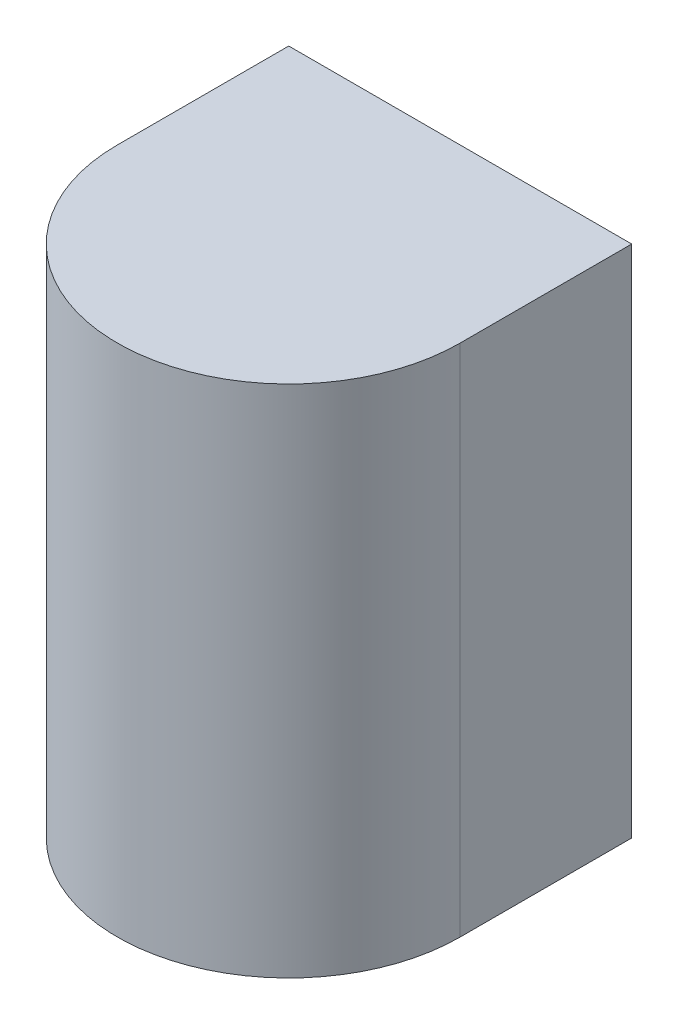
ISO-10303-21;
HEADER;
FILE_DESCRIPTION(('STEP AP214'),'2;1');
FILE_NAME('part.step','',(''),(''),'','','');
FILE_SCHEMA(('AUTOMOTIVE_DESIGN { 1 0 10303 214 1 1 1 1 }'));
ENDSEC;
DATA;
#1=APPLICATION_CONTEXT('core data for automotive mechanical design processes');
#2=APPLICATION_PROTOCOL_DEFINITION('international standard','automotive_design',2000,#1);
#3=PRODUCT_CONTEXT('',#1,'mechanical');
#4=PRODUCT('Part','Part','',(#3));
#5=PRODUCT_RELATED_PRODUCT_CATEGORY('part','',(#4));
#6=PRODUCT_DEFINITION_FORMATION('','',#4);
#7=PRODUCT_DEFINITION_CONTEXT('part definition',#1,'design');
#8=PRODUCT_DEFINITION('design','',#6,#7);
#9=PRODUCT_DEFINITION_SHAPE('','',#8);
#10=(LENGTH_UNIT() NAMED_UNIT(*) SI_UNIT(.MILLI.,.METRE.));
#11=(NAMED_UNIT(*) PLANE_ANGLE_UNIT() SI_UNIT($,.RADIAN.));
#12=(NAMED_UNIT(*) SI_UNIT($,.STERADIAN.) SOLID_ANGLE_UNIT());
#13=UNCERTAINTY_MEASURE_WITH_UNIT(LENGTH_MEASURE(1.E-05),#10,'distance_accuracy_value','');
#14=(GEOMETRIC_REPRESENTATION_CONTEXT(3) GLOBAL_UNCERTAINTY_ASSIGNED_CONTEXT((#13)) GLOBAL_UNIT_ASSIGNED_CONTEXT((#10,
#11,#12)) REPRESENTATION_CONTEXT('',''));
#15=CARTESIAN_POINT('',(0.,0.,0.));
#16=DIRECTION('',(0.,0.,1.));
#17=DIRECTION('',(1.,0.,0.));
#18=AXIS2_PLACEMENT_3D('',#15,#16,#17);
#19=CARTESIAN_POINT('',(101.6,-304.8,-101.6));
#20=DIRECTION('',(1.,0.,0.));
#21=DIRECTION('',(0.,0.,-1.));
#22=AXIS2_PLACEMENT_3D('',#19,#20,#21);
#23=PLANE('',#22);
#24=DIRECTION('',(0.,0.,-1.));
#25=VECTOR('',#24,1.);
#26=CARTESIAN_POINT('',(101.6,0.,-101.6));
#27=LINE('',#26,#25);
#28=CARTESIAN_POINT('',(101.6,0.,0.));
#29=VERTEX_POINT('',#28);
#30=CARTESIAN_POINT('',(101.6,0.,-101.6));
#31=VERTEX_POINT('',#30);
#32=EDGE_CURVE('E102',#29,#31,#27,.T.);
#33=ORIENTED_EDGE('',*,*,#32,.F.);
#34=DIRECTION('',(0.,1.,0.));
#35=VECTOR('',#34,1.);
#36=CARTESIAN_POINT('',(101.6,-304.8,0.));
#37=LINE('',#36,#35);
#38=CARTESIAN_POINT('',(101.6,-304.8,0.));
#39=VERTEX_POINT('',#38);
#40=EDGE_CURVE('E43',#39,#29,#37,.T.);
#41=ORIENTED_EDGE('',*,*,#40,.F.);
#42=DIRECTION('',(0.,0.,-1.));
#43=VECTOR('',#42,1.);
#44=CARTESIAN_POINT('',(101.6,-304.8,-101.6));
#45=LINE('',#44,#43);
#46=CARTESIAN_POINT('',(101.6,-304.8,-101.6));
#47=VERTEX_POINT('',#46);
#48=EDGE_CURVE('E95',#39,#47,#45,.T.);
#49=ORIENTED_EDGE('',*,*,#48,.T.);
#50=DIRECTION('',(0.,1.,0.));
#51=VECTOR('',#50,1.);
#52=CARTESIAN_POINT('',(101.6,-304.8,-101.6));
#53=LINE('',#52,#51);
#54=EDGE_CURVE('E78',#47,#31,#53,.T.);
#55=ORIENTED_EDGE('',*,*,#54,.T.);
#56=EDGE_LOOP('',(#33,#41,#49,#55));
#57=FACE_BOUND('',#56,.T.);
#58=ADVANCED_FACE('F35',(#57),#23,.T.);
#59=CARTESIAN_POINT('',(0.,-304.8,0.));
#60=DIRECTION('',(0.,1.,0.));
#61=DIRECTION('',(0.,0.,1.));
#62=AXIS2_PLACEMENT_3D('',#59,#60,#61);
#63=CYLINDRICAL_SURFACE('',#62,101.6);
#64=CARTESIAN_POINT('',(0.,0.,0.));
#65=DIRECTION('',(0.,1.,0.));
#66=DIRECTION('',(0.,0.,1.));
#67=AXIS2_PLACEMENT_3D('',#64,#65,#66);
#68=CIRCLE('',#67,101.6);
#69=CARTESIAN_POINT('',(-101.6,0.,0.));
#70=VERTEX_POINT('',#69);
#71=EDGE_CURVE('E97',#70,#29,#68,.T.);
#72=ORIENTED_EDGE('',*,*,#71,.F.);
#73=DIRECTION('',(0.,1.,0.));
#74=VECTOR('',#73,1.);
#75=CARTESIAN_POINT('',(-101.6,-304.8,0.));
#76=LINE('',#75,#74);
#77=CARTESIAN_POINT('',(-101.6,-304.8,0.));
#78=VERTEX_POINT('',#77);
#79=EDGE_CURVE('E67',#78,#70,#76,.T.);
#80=ORIENTED_EDGE('',*,*,#79,.F.);
#81=CARTESIAN_POINT('',(0.,-304.8,0.));
#82=DIRECTION('',(0.,1.,0.));
#83=DIRECTION('',(0.,0.,1.));
#84=AXIS2_PLACEMENT_3D('',#81,#82,#83);
#85=CIRCLE('',#84,101.6);
#86=EDGE_CURVE('E92',#78,#39,#85,.T.);
#87=ORIENTED_EDGE('',*,*,#86,.T.);
#88=ORIENTED_EDGE('',*,*,#40,.T.);
#89=EDGE_LOOP('',(#72,#80,#87,#88));
#90=FACE_BOUND('',#89,.T.);
#91=ADVANCED_FACE('F114',(#90),#63,.T.);
#92=CARTESIAN_POINT('',(-101.6,-304.8,-101.6));
#93=DIRECTION('',(-1.,0.,0.));
#94=DIRECTION('',(0.,0.,1.));
#95=AXIS2_PLACEMENT_3D('',#92,#93,#94);
#96=PLANE('',#95);
#97=DIRECTION('',(0.,0.,1.));
#98=VECTOR('',#97,1.);
#99=CARTESIAN_POINT('',(-101.6,0.,-101.6));
#100=LINE('',#99,#98);
#101=CARTESIAN_POINT('',(-101.6,0.,-101.6));
#102=VERTEX_POINT('',#101);
#103=EDGE_CURVE('E86',#102,#70,#100,.T.);
#104=ORIENTED_EDGE('',*,*,#103,.F.);
#105=DIRECTION('',(0.,1.,0.));
#106=VECTOR('',#105,1.);
#107=CARTESIAN_POINT('',(-101.6,-304.8,-101.6));
#108=LINE('',#107,#106);
#109=CARTESIAN_POINT('',(-101.6,-304.8,-101.6));
#110=VERTEX_POINT('',#109);
#111=EDGE_CURVE('E81',#110,#102,#108,.T.);
#112=ORIENTED_EDGE('',*,*,#111,.F.);
#113=DIRECTION('',(0.,0.,1.));
#114=VECTOR('',#113,1.);
#115=CARTESIAN_POINT('',(-101.6,-304.8,-101.6));
#116=LINE('',#115,#114);
#117=EDGE_CURVE('E84',#110,#78,#116,.T.);
#118=ORIENTED_EDGE('',*,*,#117,.T.);
#119=ORIENTED_EDGE('',*,*,#79,.T.);
#120=EDGE_LOOP('',(#104,#112,#118,#119));
#121=FACE_BOUND('',#120,.T.);
#122=ADVANCED_FACE('F83',(#121),#96,.T.);
#123=CARTESIAN_POINT('',(101.6,-304.8,-101.6));
#124=DIRECTION('',(0.,0.,-1.));
#125=DIRECTION('',(-1.,0.,0.));
#126=AXIS2_PLACEMENT_3D('',#123,#124,#125);
#127=PLANE('',#126);
#128=DIRECTION('',(-1.,0.,0.));
#129=VECTOR('',#128,1.);
#130=CARTESIAN_POINT('',(101.6,0.,-101.6));
#131=LINE('',#130,#129);
#132=EDGE_CURVE('E105',#31,#102,#131,.T.);
#133=ORIENTED_EDGE('',*,*,#132,.F.);
#134=ORIENTED_EDGE('',*,*,#54,.F.);
#135=DIRECTION('',(-1.,0.,0.));
#136=VECTOR('',#135,1.);
#137=CARTESIAN_POINT('',(101.6,-304.8,-101.6));
#138=LINE('',#137,#136);
#139=EDGE_CURVE('E91',#47,#110,#138,.T.);
#140=ORIENTED_EDGE('',*,*,#139,.T.);
#141=ORIENTED_EDGE('',*,*,#111,.T.);
#142=EDGE_LOOP('',(#133,#134,#140,#141));
#143=FACE_BOUND('',#142,.T.);
#144=ADVANCED_FACE('F94',(#143),#127,.T.);
#145=CARTESIAN_POINT('',(0.,-304.8,0.));
#146=DIRECTION('',(0.,1.,0.));
#147=DIRECTION('',(0.,0.,1.));
#148=AXIS2_PLACEMENT_3D('',#145,#146,#147);
#149=PLANE('',#148);
#150=CARTESIAN_POINT('',(0.,-304.8,0.));
#151=DIRECTION('',(0.,1.,0.));
#152=DIRECTION('',(0.,0.,1.));
#153=AXIS2_PLACEMENT_3D('',#150,#151,#152);
#154=CIRCLE('',#153,20.32);
#155=CARTESIAN_POINT('',(0.,-304.8,20.32));
#156=VERTEX_POINT('',#155);
#157=EDGE_CURVE('E11',#156,#156,#154,.F.);
#158=ORIENTED_EDGE('',*,*,#157,.F.);
#159=EDGE_LOOP('',(#158));
#160=FACE_BOUND('',#159,.T.);
#161=ORIENTED_EDGE('',*,*,#48,.F.);
#162=ORIENTED_EDGE('',*,*,#86,.F.);
#163=ORIENTED_EDGE('',*,*,#117,.F.);
#164=ORIENTED_EDGE('',*,*,#139,.F.);
#165=EDGE_LOOP('',(#161,#162,#163,#164));
#166=FACE_BOUND('',#165,.T.);
#167=ADVANCED_FACE('F90',(#160,#166),#149,.F.);
#168=CARTESIAN_POINT('',(0.,0.,0.));
#169=DIRECTION('',(0.,1.,0.));
#170=DIRECTION('',(0.,0.,1.));
#171=AXIS2_PLACEMENT_3D('',#168,#169,#170);
#172=PLANE('',#171);
#173=ORIENTED_EDGE('',*,*,#32,.T.);
#174=ORIENTED_EDGE('',*,*,#132,.T.);
#175=ORIENTED_EDGE('',*,*,#103,.T.);
#176=ORIENTED_EDGE('',*,*,#71,.T.);
#177=EDGE_LOOP('',(#173,#174,#175,#176));
#178=FACE_BOUND('',#177,.T.);
#179=ADVANCED_FACE('F113',(#178),#172,.T.);
#180=CARTESIAN_POINT('',(0.,-321.564,0.));
#181=DIRECTION('',(0.,-1.,0.));
#182=DIRECTION('',(0.,0.,-1.));
#183=AXIS2_PLACEMENT_3D('',#180,#181,#182);
#184=PLANE('',#183);
#185=CARTESIAN_POINT('',(0.,-321.564,0.));
#186=DIRECTION('',(0.,-1.,0.));
#187=DIRECTION('',(0.,0.,-1.));
#188=AXIS2_PLACEMENT_3D('',#185,#186,#187);
#189=CIRCLE('',#188,20.32);
#190=CARTESIAN_POINT('',(0.,-321.564,-20.32));
#191=VERTEX_POINT('',#190);
#192=EDGE_CURVE('E106',#191,#191,#189,.T.);
#193=ORIENTED_EDGE('',*,*,#192,.T.);
#194=EDGE_LOOP('',(#193));
#195=FACE_BOUND('',#194,.T.);
#196=CARTESIAN_POINT('',(0.,-321.564,0.));
#197=DIRECTION('',(0.,-1.,0.));
#198=DIRECTION('',(0.,0.,-1.));
#199=AXIS2_PLACEMENT_3D('',#196,#197,#198);
#200=CIRCLE('',#199,12.7);
#201=CARTESIAN_POINT('',(0.,-321.564,-12.7));
#202=VERTEX_POINT('',#201);
#203=EDGE_CURVE('E151',#202,#202,#200,.T.);
#204=ORIENTED_EDGE('',*,*,#203,.F.);
#205=EDGE_LOOP('',(#204));
#206=FACE_BOUND('',#205,.T.);
#207=ADVANCED_FACE('F135',(#195,#206),#184,.T.);
#208=CARTESIAN_POINT('',(0.,-321.564,0.));
#209=DIRECTION('',(0.,1.,0.));
#210=DIRECTION('',(0.,0.,1.));
#211=AXIS2_PLACEMENT_3D('',#208,#209,#210);
#212=CYLINDRICAL_SURFACE('',#211,20.32);
#213=ORIENTED_EDGE('',*,*,#192,.F.);
#214=EDGE_LOOP('',(#213));
#215=FACE_BOUND('',#214,.T.);
#216=ORIENTED_EDGE('',*,*,#157,.T.);
#217=EDGE_LOOP('',(#216));
#218=FACE_BOUND('',#217,.T.);
#219=ADVANCED_FACE('F144',(#215,#218),#212,.T.);
#220=CARTESIAN_POINT('',(0.,-321.564,0.));
#221=DIRECTION('',(0.,1.,0.));
#222=DIRECTION('',(0.,0.,1.));
#223=AXIS2_PLACEMENT_3D('',#220,#221,#222);
#224=CYLINDRICAL_SURFACE('',#223,12.7);
#225=ORIENTED_EDGE('',*,*,#203,.T.);
#226=EDGE_LOOP('',(#225));
#227=FACE_BOUND('',#226,.T.);
#228=CARTESIAN_POINT('',(0.,-304.8,0.));
#229=DIRECTION('',(0.,-1.,0.));
#230=DIRECTION('',(0.,0.,-1.));
#231=AXIS2_PLACEMENT_3D('',#228,#229,#230);
#232=CIRCLE('',#231,12.7);
#233=CARTESIAN_POINT('',(0.,-304.8,-12.7));
#234=VERTEX_POINT('',#233);
#235=EDGE_CURVE('E149',#234,#234,#232,.T.);
#236=ORIENTED_EDGE('',*,*,#235,.F.);
#237=EDGE_LOOP('',(#236));
#238=FACE_BOUND('',#237,.T.);
#239=ADVANCED_FACE('F138',(#227,#238),#224,.F.);
#240=ORIENTED_EDGE('',*,*,#235,.T.);
#241=EDGE_LOOP('',(#240));
#242=FACE_BOUND('',#241,.T.);
#243=ADVANCED_FACE('F130',(#242),#149,.F.);
#244=CLOSED_SHELL('',(#58,#91,#122,#144,#167,#179,#207,#219,#239,#243));
#245=MANIFOLD_SOLID_BREP('B2',#244);
#246=ADVANCED_BREP_SHAPE_REPRESENTATION('',(#18,#245),#14);
#247=SHAPE_DEFINITION_REPRESENTATION(#9,#246);
ENDSEC;
END-ISO-10303-21;
